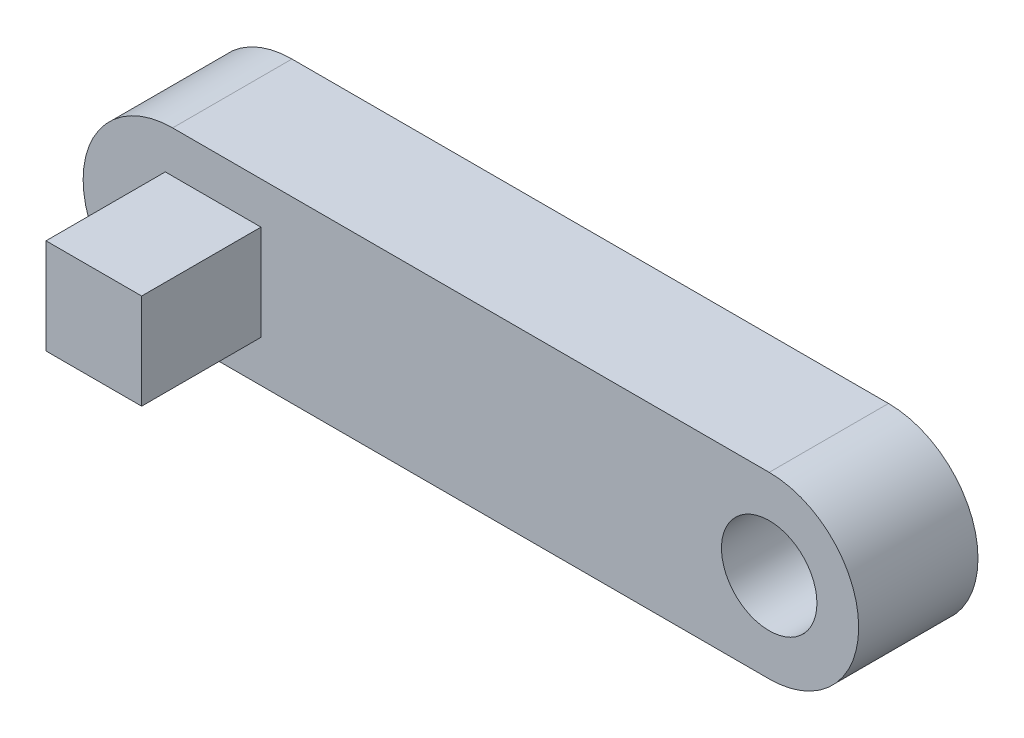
from build123d import *

# Parameters (mm, degrees)
SKETCH1_R           = 10.16
BASE_EXTRUDE_DEPTH  = 25.4
SKETCH2_W           = 20.360198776
SKETCH2_H           = 20.32
BOSS_EXTRUDE1_DEPTH = 25.4


with BuildPart() as part:
    # Sketch1 → Base-Extrude (new body)
    with BuildSketch(Plane.XY):
        with BuildLine():
            Line((132.040466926, 0), (5.040466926, 0))
            ThreePointArc((5.040466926, 0), (-14.009533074, 19.05), (5.040466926, 38.1))
            Line((5.040466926, 38.1), (132.040466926, 38.1))
            ThreePointArc((132.040466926, 38.1), (151.090466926, 19.05), (132.040466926, 0))
        make_face()
        with Locations((132.040466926, 19.05)):
            Circle(SKETCH1_R, mode=Mode.SUBTRACT)
    extrude(amount=-BASE_EXTRUDE_DEPTH)

    # Sketch2 → Boss-Extrude1 (add)
    with BuildSketch(Plane.XY):
        with Locations((13.665769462, 19.05)):
            Rectangle(SKETCH2_W, SKETCH2_H)
    extrude(amount=BOSS_EXTRUDE1_DEPTH)


solid = part.part
